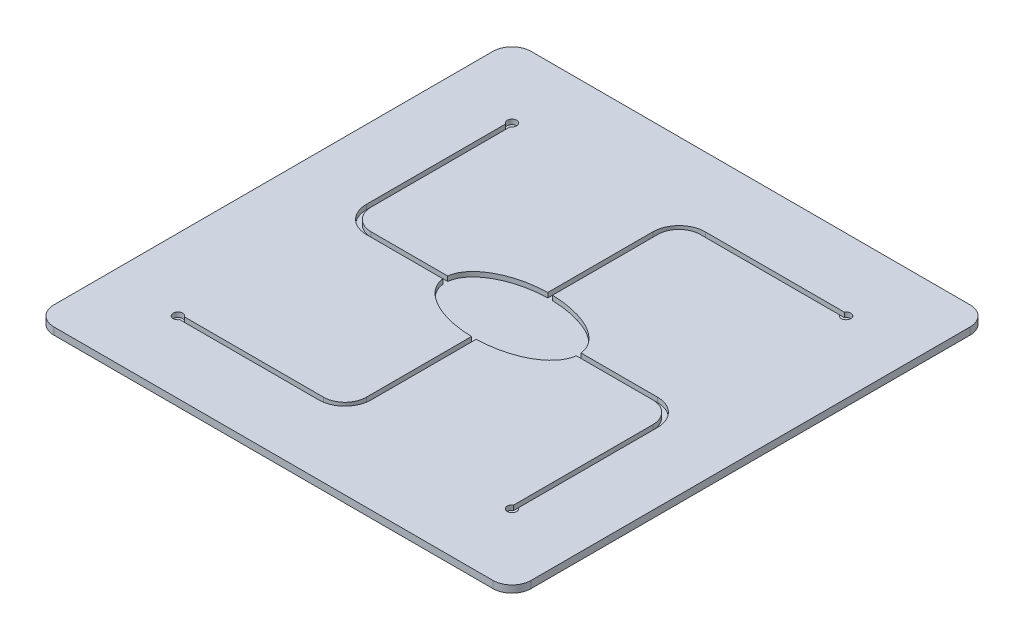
ISO-10303-21;
HEADER;
FILE_DESCRIPTION(('STEP AP214'),'2;1');
FILE_NAME('part.step','',(''),(''),'','','');
FILE_SCHEMA(('AUTOMOTIVE_DESIGN { 1 0 10303 214 1 1 1 1 }'));
ENDSEC;
DATA;
#1=APPLICATION_CONTEXT('core data for automotive mechanical design processes');
#2=APPLICATION_PROTOCOL_DEFINITION('international standard','automotive_design',2000,#1);
#3=PRODUCT_CONTEXT('',#1,'mechanical');
#4=PRODUCT('Part','Part','',(#3));
#5=PRODUCT_RELATED_PRODUCT_CATEGORY('part','',(#4));
#6=PRODUCT_DEFINITION_FORMATION('','',#4);
#7=PRODUCT_DEFINITION_CONTEXT('part definition',#1,'design');
#8=PRODUCT_DEFINITION('design','',#6,#7);
#9=PRODUCT_DEFINITION_SHAPE('','',#8);
#10=(LENGTH_UNIT() NAMED_UNIT(*) SI_UNIT(.MILLI.,.METRE.));
#11=(NAMED_UNIT(*) PLANE_ANGLE_UNIT() SI_UNIT($,.RADIAN.));
#12=(NAMED_UNIT(*) SI_UNIT($,.STERADIAN.) SOLID_ANGLE_UNIT());
#13=UNCERTAINTY_MEASURE_WITH_UNIT(LENGTH_MEASURE(1.E-05),#10,'distance_accuracy_value','');
#14=(GEOMETRIC_REPRESENTATION_CONTEXT(3) GLOBAL_UNCERTAINTY_ASSIGNED_CONTEXT((#13)) GLOBAL_UNIT_ASSIGNED_CONTEXT((#10,
#11,#12)) REPRESENTATION_CONTEXT('',''));
#15=CARTESIAN_POINT('',(0.,0.,0.));
#16=DIRECTION('',(0.,0.,1.));
#17=DIRECTION('',(1.,0.,0.));
#18=AXIS2_PLACEMENT_3D('',#15,#16,#17);
#19=CARTESIAN_POINT('',(-46.,1.5,46.));
#20=DIRECTION('',(0.,-1.,0.));
#21=DIRECTION('',(0.,0.,-1.));
#22=AXIS2_PLACEMENT_3D('',#19,#20,#21);
#23=CYLINDRICAL_SURFACE('',#22,4.);
#24=CARTESIAN_POINT('',(-46.,0.,46.));
#25=DIRECTION('',(0.,1.,0.));
#26=DIRECTION('',(0.,0.,-1.));
#27=AXIS2_PLACEMENT_3D('',#24,#25,#26);
#28=CIRCLE('',#27,4.);
#29=CARTESIAN_POINT('',(-50.,0.,46.));
#30=VERTEX_POINT('',#29);
#31=CARTESIAN_POINT('',(-45.9999999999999,0.,50.));
#32=VERTEX_POINT('',#31);
#33=EDGE_CURVE('E539',#30,#32,#28,.T.);
#34=ORIENTED_EDGE('',*,*,#33,.T.);
#35=DIRECTION('',(0.,-1.,0.));
#36=VECTOR('',#35,1.);
#37=CARTESIAN_POINT('',(-45.9999999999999,1.5,50.));
#38=LINE('',#37,#36);
#39=CARTESIAN_POINT('',(-45.9999999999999,1.5,50.));
#40=VERTEX_POINT('',#39);
#41=EDGE_CURVE('E611',#40,#32,#38,.T.);
#42=ORIENTED_EDGE('',*,*,#41,.F.);
#43=CARTESIAN_POINT('',(-46.,1.5,46.));
#44=DIRECTION('',(0.,1.,0.));
#45=DIRECTION('',(0.,0.,-1.));
#46=AXIS2_PLACEMENT_3D('',#43,#44,#45);
#47=CIRCLE('',#46,4.);
#48=CARTESIAN_POINT('',(-50.,1.5,46.));
#49=VERTEX_POINT('',#48);
#50=EDGE_CURVE('E557',#49,#40,#47,.T.);
#51=ORIENTED_EDGE('',*,*,#50,.F.);
#52=DIRECTION('',(0.,-1.,0.));
#53=VECTOR('',#52,1.);
#54=CARTESIAN_POINT('',(-50.,1.5,46.));
#55=LINE('',#54,#53);
#56=EDGE_CURVE('E575',#49,#30,#55,.T.);
#57=ORIENTED_EDGE('',*,*,#56,.T.);
#58=EDGE_LOOP('',(#34,#42,#51,#57));
#59=FACE_BOUND('',#58,.T.);
#60=ADVANCED_FACE('F148',(#59),#23,.T.);
#61=CARTESIAN_POINT('',(46.,1.5,50.));
#62=DIRECTION('',(0.,0.,-1.));
#63=DIRECTION('',(-1.,0.,0.));
#64=AXIS2_PLACEMENT_3D('',#61,#62,#63);
#65=PLANE('',#64);
#66=DIRECTION('',(1.,0.,0.));
#67=VECTOR('',#66,1.);
#68=CARTESIAN_POINT('',(46.,0.,50.));
#69=LINE('',#68,#67);
#70=CARTESIAN_POINT('',(46.,0.,50.));
#71=VERTEX_POINT('',#70);
#72=EDGE_CURVE('E578',#32,#71,#69,.T.);
#73=ORIENTED_EDGE('',*,*,#72,.T.);
#74=DIRECTION('',(0.,-1.,0.));
#75=VECTOR('',#74,1.);
#76=CARTESIAN_POINT('',(46.,1.5,50.));
#77=LINE('',#76,#75);
#78=CARTESIAN_POINT('',(46.,1.5,50.));
#79=VERTEX_POINT('',#78);
#80=EDGE_CURVE('E608',#79,#71,#77,.T.);
#81=ORIENTED_EDGE('',*,*,#80,.F.);
#82=DIRECTION('',(1.,0.,0.));
#83=VECTOR('',#82,1.);
#84=CARTESIAN_POINT('',(46.,1.5,50.));
#85=LINE('',#84,#83);
#86=EDGE_CURVE('E560',#40,#79,#85,.T.);
#87=ORIENTED_EDGE('',*,*,#86,.F.);
#88=ORIENTED_EDGE('',*,*,#41,.T.);
#89=EDGE_LOOP('',(#73,#81,#87,#88));
#90=FACE_BOUND('',#89,.T.);
#91=ADVANCED_FACE('F807',(#90),#65,.F.);
#92=CARTESIAN_POINT('',(46.,1.5,46.));
#93=DIRECTION('',(0.,-1.,0.));
#94=DIRECTION('',(0.,0.,-1.));
#95=AXIS2_PLACEMENT_3D('',#92,#93,#94);
#96=CYLINDRICAL_SURFACE('',#95,4.);
#97=CARTESIAN_POINT('',(46.,0.,46.));
#98=DIRECTION('',(0.,1.,0.));
#99=DIRECTION('',(0.,0.,1.));
#100=AXIS2_PLACEMENT_3D('',#97,#98,#99);
#101=CIRCLE('',#100,4.);
#102=CARTESIAN_POINT('',(50.,0.,46.));
#103=VERTEX_POINT('',#102);
#104=EDGE_CURVE('E580',#71,#103,#101,.T.);
#105=ORIENTED_EDGE('',*,*,#104,.T.);
#106=DIRECTION('',(0.,-1.,0.));
#107=VECTOR('',#106,1.);
#108=CARTESIAN_POINT('',(50.,1.5,46.));
#109=LINE('',#108,#107);
#110=CARTESIAN_POINT('',(50.,1.5,46.));
#111=VERTEX_POINT('',#110);
#112=EDGE_CURVE('E605',#111,#103,#109,.T.);
#113=ORIENTED_EDGE('',*,*,#112,.F.);
#114=CARTESIAN_POINT('',(46.,1.5,46.));
#115=DIRECTION('',(0.,1.,0.));
#116=DIRECTION('',(0.,0.,1.));
#117=AXIS2_PLACEMENT_3D('',#114,#115,#116);
#118=CIRCLE('',#117,4.);
#119=EDGE_CURVE('E563',#79,#111,#118,.T.);
#120=ORIENTED_EDGE('',*,*,#119,.F.);
#121=ORIENTED_EDGE('',*,*,#80,.T.);
#122=EDGE_LOOP('',(#105,#113,#120,#121));
#123=FACE_BOUND('',#122,.T.);
#124=ADVANCED_FACE('F804',(#123),#96,.T.);
#125=CARTESIAN_POINT('',(50.,1.5,46.));
#126=DIRECTION('',(-1.,0.,0.));
#127=DIRECTION('',(0.,0.,1.));
#128=AXIS2_PLACEMENT_3D('',#125,#126,#127);
#129=PLANE('',#128);
#130=DIRECTION('',(0.,0.,-1.));
#131=VECTOR('',#130,1.);
#132=CARTESIAN_POINT('',(50.,0.,46.));
#133=LINE('',#132,#131);
#134=CARTESIAN_POINT('',(50.,0.,-46.));
#135=VERTEX_POINT('',#134);
#136=EDGE_CURVE('E582',#103,#135,#133,.T.);
#137=ORIENTED_EDGE('',*,*,#136,.T.);
#138=DIRECTION('',(0.,-1.,0.));
#139=VECTOR('',#138,1.);
#140=CARTESIAN_POINT('',(50.,1.5,-46.));
#141=LINE('',#140,#139);
#142=CARTESIAN_POINT('',(50.,1.5,-46.));
#143=VERTEX_POINT('',#142);
#144=EDGE_CURVE('E602',#143,#135,#141,.T.);
#145=ORIENTED_EDGE('',*,*,#144,.F.);
#146=DIRECTION('',(0.,0.,-1.));
#147=VECTOR('',#146,1.);
#148=CARTESIAN_POINT('',(50.,1.5,46.));
#149=LINE('',#148,#147);
#150=EDGE_CURVE('E565',#111,#143,#149,.T.);
#151=ORIENTED_EDGE('',*,*,#150,.F.);
#152=ORIENTED_EDGE('',*,*,#112,.T.);
#153=EDGE_LOOP('',(#137,#145,#151,#152));
#154=FACE_BOUND('',#153,.T.);
#155=ADVANCED_FACE('F800',(#154),#129,.F.);
#156=CARTESIAN_POINT('',(46.,1.5,-46.));
#157=DIRECTION('',(0.,-1.,0.));
#158=DIRECTION('',(0.,0.,-1.));
#159=AXIS2_PLACEMENT_3D('',#156,#157,#158);
#160=CYLINDRICAL_SURFACE('',#159,4.);
#161=CARTESIAN_POINT('',(46.,0.,-46.));
#162=DIRECTION('',(0.,1.,0.));
#163=DIRECTION('',(0.,0.,-1.));
#164=AXIS2_PLACEMENT_3D('',#161,#162,#163);
#165=CIRCLE('',#164,4.);
#166=CARTESIAN_POINT('',(46.,0.,-50.));
#167=VERTEX_POINT('',#166);
#168=EDGE_CURVE('E584',#135,#167,#165,.T.);
#169=ORIENTED_EDGE('',*,*,#168,.T.);
#170=DIRECTION('',(0.,-1.,0.));
#171=VECTOR('',#170,1.);
#172=CARTESIAN_POINT('',(46.,1.5,-50.));
#173=LINE('',#172,#171);
#174=CARTESIAN_POINT('',(46.,1.5,-50.));
#175=VERTEX_POINT('',#174);
#176=EDGE_CURVE('E599',#175,#167,#173,.T.);
#177=ORIENTED_EDGE('',*,*,#176,.F.);
#178=CARTESIAN_POINT('',(46.,1.5,-46.));
#179=DIRECTION('',(0.,1.,0.));
#180=DIRECTION('',(0.,0.,-1.));
#181=AXIS2_PLACEMENT_3D('',#178,#179,#180);
#182=CIRCLE('',#181,4.);
#183=EDGE_CURVE('E567',#143,#175,#182,.T.);
#184=ORIENTED_EDGE('',*,*,#183,.F.);
#185=ORIENTED_EDGE('',*,*,#144,.T.);
#186=EDGE_LOOP('',(#169,#177,#184,#185));
#187=FACE_BOUND('',#186,.T.);
#188=ADVANCED_FACE('F796',(#187),#160,.T.);
#189=CARTESIAN_POINT('',(46.,1.5,-50.));
#190=DIRECTION('',(0.,0.,1.));
#191=DIRECTION('',(1.,0.,0.));
#192=AXIS2_PLACEMENT_3D('',#189,#190,#191);
#193=PLANE('',#192);
#194=DIRECTION('',(-1.,0.,0.));
#195=VECTOR('',#194,1.);
#196=CARTESIAN_POINT('',(46.,0.,-50.));
#197=LINE('',#196,#195);
#198=CARTESIAN_POINT('',(-45.9999999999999,0.,-50.));
#199=VERTEX_POINT('',#198);
#200=EDGE_CURVE('E586',#167,#199,#197,.T.);
#201=ORIENTED_EDGE('',*,*,#200,.T.);
#202=DIRECTION('',(0.,-1.,0.));
#203=VECTOR('',#202,1.);
#204=CARTESIAN_POINT('',(-45.9999999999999,1.5,-50.));
#205=LINE('',#204,#203);
#206=CARTESIAN_POINT('',(-45.9999999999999,1.5,-50.));
#207=VERTEX_POINT('',#206);
#208=EDGE_CURVE('E596',#207,#199,#205,.T.);
#209=ORIENTED_EDGE('',*,*,#208,.F.);
#210=DIRECTION('',(-1.,0.,0.));
#211=VECTOR('',#210,1.);
#212=CARTESIAN_POINT('',(46.,1.5,-50.));
#213=LINE('',#212,#211);
#214=EDGE_CURVE('E569',#175,#207,#213,.T.);
#215=ORIENTED_EDGE('',*,*,#214,.F.);
#216=ORIENTED_EDGE('',*,*,#176,.T.);
#217=EDGE_LOOP('',(#201,#209,#215,#216));
#218=FACE_BOUND('',#217,.T.);
#219=ADVANCED_FACE('F792',(#218),#193,.F.);
#220=CARTESIAN_POINT('',(-46.,1.5,-46.));
#221=DIRECTION('',(0.,-1.,0.));
#222=DIRECTION('',(0.,0.,-1.));
#223=AXIS2_PLACEMENT_3D('',#220,#221,#222);
#224=CYLINDRICAL_SURFACE('',#223,4.);
#225=CARTESIAN_POINT('',(-46.,0.,-46.));
#226=DIRECTION('',(0.,1.,0.));
#227=DIRECTION('',(0.,0.,-1.));
#228=AXIS2_PLACEMENT_3D('',#225,#226,#227);
#229=CIRCLE('',#228,4.);
#230=CARTESIAN_POINT('',(-50.,0.,-46.));
#231=VERTEX_POINT('',#230);
#232=EDGE_CURVE('E588',#199,#231,#229,.T.);
#233=ORIENTED_EDGE('',*,*,#232,.T.);
#234=DIRECTION('',(0.,-1.,0.));
#235=VECTOR('',#234,1.);
#236=CARTESIAN_POINT('',(-50.,1.5,-46.));
#237=LINE('',#236,#235);
#238=CARTESIAN_POINT('',(-50.,1.5,-46.));
#239=VERTEX_POINT('',#238);
#240=EDGE_CURVE('E593',#239,#231,#237,.T.);
#241=ORIENTED_EDGE('',*,*,#240,.F.);
#242=CARTESIAN_POINT('',(-46.,1.5,-46.));
#243=DIRECTION('',(0.,1.,0.));
#244=DIRECTION('',(0.,0.,-1.));
#245=AXIS2_PLACEMENT_3D('',#242,#243,#244);
#246=CIRCLE('',#245,4.);
#247=EDGE_CURVE('E571',#207,#239,#246,.T.);
#248=ORIENTED_EDGE('',*,*,#247,.F.);
#249=ORIENTED_EDGE('',*,*,#208,.T.);
#250=EDGE_LOOP('',(#233,#241,#248,#249));
#251=FACE_BOUND('',#250,.T.);
#252=ADVANCED_FACE('F788',(#251),#224,.T.);
#253=CARTESIAN_POINT('',(-50.,1.5,46.));
#254=DIRECTION('',(1.,0.,0.));
#255=DIRECTION('',(0.,0.,-1.));
#256=AXIS2_PLACEMENT_3D('',#253,#254,#255);
#257=PLANE('',#256);
#258=DIRECTION('',(0.,0.,1.));
#259=VECTOR('',#258,1.);
#260=CARTESIAN_POINT('',(-50.,0.,46.));
#261=LINE('',#260,#259);
#262=EDGE_CURVE('E561',#231,#30,#261,.T.);
#263=ORIENTED_EDGE('',*,*,#262,.T.);
#264=ORIENTED_EDGE('',*,*,#56,.F.);
#265=DIRECTION('',(0.,0.,1.));
#266=VECTOR('',#265,1.);
#267=CARTESIAN_POINT('',(-50.,1.5,46.));
#268=LINE('',#267,#266);
#269=EDGE_CURVE('E573',#239,#49,#268,.T.);
#270=ORIENTED_EDGE('',*,*,#269,.F.);
#271=ORIENTED_EDGE('',*,*,#240,.T.);
#272=EDGE_LOOP('',(#263,#264,#270,#271));
#273=FACE_BOUND('',#272,.T.);
#274=ADVANCED_FACE('F782',(#273),#257,.F.);
#275=CARTESIAN_POINT('',(-46.,1.5,46.));
#276=DIRECTION('',(0.,-1.,0.));
#277=DIRECTION('',(0.,0.,-1.));
#278=AXIS2_PLACEMENT_3D('',#275,#276,#277);
#279=PLANE('',#278);
#280=DIRECTION('',(-1.,0.,0.));
#281=VECTOR('',#280,1.);
#282=CARTESIAN_POINT('',(-5.00000000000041,1.5,35.4999999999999));
#283=LINE('',#282,#281);
#284=CARTESIAN_POINT('',(-5.00000000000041,1.5,35.4999999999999));
#285=VERTEX_POINT('',#284);
#286=CARTESIAN_POINT('',(-34.1339745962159,1.5,35.4999999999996));
#287=VERTEX_POINT('',#286);
#288=EDGE_CURVE('E419',#285,#287,#283,.T.);
#289=ORIENTED_EDGE('',*,*,#288,.T.);
#290=CARTESIAN_POINT('',(-35.0000000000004,1.5,34.9999999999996));
#291=DIRECTION('',(0.,1.,0.));
#292=DIRECTION('',(0.,0.,1.));
#293=AXIS2_PLACEMENT_3D('',#290,#291,#292);
#294=CIRCLE('',#293,0.999999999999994);
#295=CARTESIAN_POINT('',(-34.1339745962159,1.5,34.4999999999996));
#296=VERTEX_POINT('',#295);
#297=EDGE_CURVE('E401',#296,#287,#294,.T.);
#298=ORIENTED_EDGE('',*,*,#297,.F.);
#299=DIRECTION('',(-1.,0.,0.));
#300=VECTOR('',#299,1.);
#301=CARTESIAN_POINT('',(-5.0000000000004,1.5,34.4999999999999));
#302=LINE('',#301,#300);
#303=CARTESIAN_POINT('',(-5.0000000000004,1.5,34.4999999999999));
#304=VERTEX_POINT('',#303);
#305=EDGE_CURVE('E428',#304,#296,#302,.T.);
#306=ORIENTED_EDGE('',*,*,#305,.F.);
#307=CARTESIAN_POINT('',(-5.00000000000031,1.5,29.9999999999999));
#308=DIRECTION('',(0.,1.,0.));
#309=DIRECTION('',(1.,0.,0.));
#310=AXIS2_PLACEMENT_3D('',#307,#308,#309);
#311=CIRCLE('',#310,4.5);
#312=CARTESIAN_POINT('',(-0.500000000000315,1.5,29.9999999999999));
#313=VERTEX_POINT('',#312);
#314=EDGE_CURVE('E453',#313,#304,#311,.F.);
#315=ORIENTED_EDGE('',*,*,#314,.F.);
#316=DIRECTION('',(0.,0.,1.));
#317=VECTOR('',#316,1.);
#318=CARTESIAN_POINT('',(-0.500000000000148,1.5,14.));
#319=LINE('',#318,#317);
#320=CARTESIAN_POINT('',(-0.500000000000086,1.5,7.99489633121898));
#321=VERTEX_POINT('',#320);
#322=EDGE_CURVE('E449',#321,#313,#319,.T.);
#323=ORIENTED_EDGE('',*,*,#322,.F.);
#324=CARTESIAN_POINT('',(0.,1.5,0.));
#325=DIRECTION('',(0.,1.,0.));
#326=DIRECTION('',(-1.,0.,0.));
#327=AXIS2_PLACEMENT_3D('',#324,#325,#326);
#328=ELLIPSE('',#327,14.,8.);
#329=CARTESIAN_POINT('',(-13.9726294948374,1.5,0.499999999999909));
#330=VERTEX_POINT('',#329);
#331=EDGE_CURVE('E627',#330,#321,#328,.T.);
#332=ORIENTED_EDGE('',*,*,#331,.F.);
#333=DIRECTION('',(1.,0.,0.));
#334=VECTOR('',#333,1.);
#335=CARTESIAN_POINT('',(14.,1.5,0.500000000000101));
#336=LINE('',#335,#334);
#337=CARTESIAN_POINT('',(-29.9999999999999,1.5,0.499999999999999));
#338=VERTEX_POINT('',#337);
#339=EDGE_CURVE('E532',#338,#330,#336,.T.);
#340=ORIENTED_EDGE('',*,*,#339,.F.);
#341=CARTESIAN_POINT('',(-30.,1.5,-5.));
#342=DIRECTION('',(0.,1.,0.));
#343=DIRECTION('',(1.,0.,0.));
#344=AXIS2_PLACEMENT_3D('',#341,#342,#343);
#345=CIRCLE('',#344,5.5);
#346=CARTESIAN_POINT('',(-35.5,1.5,-5.00000000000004));
#347=VERTEX_POINT('',#346);
#348=EDGE_CURVE('E528',#347,#338,#345,.T.);
#349=ORIENTED_EDGE('',*,*,#348,.F.);
#350=DIRECTION('',(0.,0.,-1.));
#351=VECTOR('',#350,1.);
#352=CARTESIAN_POINT('',(-35.5,1.5,-5.00000000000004));
#353=LINE('',#352,#351);
#354=CARTESIAN_POINT('',(-35.5,1.5,-34.1339745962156));
#355=VERTEX_POINT('',#354);
#356=EDGE_CURVE('E526',#355,#347,#353,.F.);
#357=ORIENTED_EDGE('',*,*,#356,.F.);
#358=CARTESIAN_POINT('',(-35.,1.5,-35.));
#359=DIRECTION('',(0.,1.,0.));
#360=DIRECTION('',(0.,0.,1.));
#361=AXIS2_PLACEMENT_3D('',#358,#359,#360);
#362=CIRCLE('',#361,0.999999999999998);
#363=CARTESIAN_POINT('',(-34.5,1.5,-34.1339745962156));
#364=VERTEX_POINT('',#363);
#365=EDGE_CURVE('E677',#364,#355,#362,.T.);
#366=ORIENTED_EDGE('',*,*,#365,.F.);
#367=DIRECTION('',(0.,0.,-1.));
#368=VECTOR('',#367,1.);
#369=CARTESIAN_POINT('',(-34.5,1.5,-5.00000000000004));
#370=LINE('',#369,#368);
#371=CARTESIAN_POINT('',(-34.5,1.5,-5.00000000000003));
#372=VERTEX_POINT('',#371);
#373=EDGE_CURVE('E524',#364,#372,#370,.F.);
#374=ORIENTED_EDGE('',*,*,#373,.T.);
#375=CARTESIAN_POINT('',(-30.,1.5,-5.));
#376=DIRECTION('',(0.,1.,0.));
#377=DIRECTION('',(1.,0.,0.));
#378=AXIS2_PLACEMENT_3D('',#375,#376,#377);
#379=CIRCLE('',#378,4.5);
#380=CARTESIAN_POINT('',(-29.9999999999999,1.5,-0.500000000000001));
#381=VERTEX_POINT('',#380);
#382=EDGE_CURVE('E521',#372,#381,#379,.T.);
#383=ORIENTED_EDGE('',*,*,#382,.T.);
#384=DIRECTION('',(1.,0.,0.));
#385=VECTOR('',#384,1.);
#386=CARTESIAN_POINT('',(-14.,1.5,-0.500000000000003));
#387=LINE('',#386,#385);
#388=CARTESIAN_POINT('',(-13.9726294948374,1.5,-0.500000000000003));
#389=VERTEX_POINT('',#388);
#390=EDGE_CURVE('E518',#381,#389,#387,.T.);
#391=ORIENTED_EDGE('',*,*,#390,.T.);
#392=CARTESIAN_POINT('',(-0.499999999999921,1.5,-7.99489633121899));
#393=VERTEX_POINT('',#392);
#394=EDGE_CURVE('E690',#393,#389,#328,.T.);
#395=ORIENTED_EDGE('',*,*,#394,.F.);
#396=CARTESIAN_POINT('',(-0.499999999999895,1.5,-29.9999999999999));
#397=VERTEX_POINT('',#396);
#398=EDGE_CURVE('E450',#397,#393,#319,.T.);
#399=ORIENTED_EDGE('',*,*,#398,.F.);
#400=CARTESIAN_POINT('',(5.0000000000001,1.5,-30.));
#401=DIRECTION('',(0.,1.,0.));
#402=DIRECTION('',(1.,0.,0.));
#403=AXIS2_PLACEMENT_3D('',#400,#401,#402);
#404=CIRCLE('',#403,5.5);
#405=CARTESIAN_POINT('',(5.00000000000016,1.5,-35.5));
#406=VERTEX_POINT('',#405);
#407=EDGE_CURVE('E446',#406,#397,#404,.T.);
#408=ORIENTED_EDGE('',*,*,#407,.F.);
#409=DIRECTION('',(-1.,0.,0.));
#410=VECTOR('',#409,1.);
#411=CARTESIAN_POINT('',(5.00000000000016,1.5,-35.5));
#412=LINE('',#411,#410);
#413=CARTESIAN_POINT('',(34.1339745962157,1.5,-35.4999999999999));
#414=VERTEX_POINT('',#413);
#415=EDGE_CURVE('E444',#414,#406,#412,.T.);
#416=ORIENTED_EDGE('',*,*,#415,.F.);
#417=CARTESIAN_POINT('',(35.0000000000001,1.5,-34.9999999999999));
#418=DIRECTION('',(0.,1.,0.));
#419=DIRECTION('',(0.,0.,1.));
#420=AXIS2_PLACEMENT_3D('',#417,#418,#419);
#421=CIRCLE('',#420,0.999999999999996);
#422=CARTESIAN_POINT('',(34.1339745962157,1.5,-34.4999999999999));
#423=VERTEX_POINT('',#422);
#424=EDGE_CURVE('E1304',#423,#414,#421,.T.);
#425=ORIENTED_EDGE('',*,*,#424,.F.);
#426=DIRECTION('',(-1.,0.,0.));
#427=VECTOR('',#426,1.);
#428=CARTESIAN_POINT('',(5.00000000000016,1.5,-34.5));
#429=LINE('',#428,#427);
#430=CARTESIAN_POINT('',(5.00000000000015,1.5,-34.5));
#431=VERTEX_POINT('',#430);
#432=EDGE_CURVE('E442',#423,#431,#429,.T.);
#433=ORIENTED_EDGE('',*,*,#432,.T.);
#434=CARTESIAN_POINT('',(5.0000000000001,1.5,-30.));
#435=DIRECTION('',(0.,1.,0.));
#436=DIRECTION('',(1.,0.,0.));
#437=AXIS2_PLACEMENT_3D('',#434,#435,#436);
#438=CIRCLE('',#437,4.5);
#439=CARTESIAN_POINT('',(0.500000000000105,1.5,-29.9999999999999));
#440=VERTEX_POINT('',#439);
#441=EDGE_CURVE('E439',#431,#440,#438,.T.);
#442=ORIENTED_EDGE('',*,*,#441,.T.);
#443=DIRECTION('',(0.,0.,1.));
#444=VECTOR('',#443,1.);
#445=CARTESIAN_POINT('',(0.500000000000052,1.5,-14.));
#446=LINE('',#445,#444);
#447=CARTESIAN_POINT('',(0.500000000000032,1.5,-7.99489633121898));
#448=VERTEX_POINT('',#447);
#449=EDGE_CURVE('E436',#440,#448,#446,.T.);
#450=ORIENTED_EDGE('',*,*,#449,.T.);
#451=CARTESIAN_POINT('',(13.9726294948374,1.5,-0.500000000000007));
#452=VERTEX_POINT('',#451);
#453=EDGE_CURVE('E628',#452,#448,#328,.T.);
#454=ORIENTED_EDGE('',*,*,#453,.F.);
#455=CARTESIAN_POINT('',(29.9999999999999,1.5,-0.49999999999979));
#456=VERTEX_POINT('',#455);
#457=EDGE_CURVE('E517',#452,#456,#387,.T.);
#458=ORIENTED_EDGE('',*,*,#457,.T.);
#459=CARTESIAN_POINT('',(29.9999999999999,1.5,5.00000000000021));
#460=DIRECTION('',(0.,1.,0.));
#461=DIRECTION('',(1.,0.,0.));
#462=AXIS2_PLACEMENT_3D('',#459,#460,#461);
#463=CIRCLE('',#462,5.5);
#464=CARTESIAN_POINT('',(35.4999999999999,1.5,5.00000000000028));
#465=VERTEX_POINT('',#464);
#466=EDGE_CURVE('E514',#456,#465,#463,.F.);
#467=ORIENTED_EDGE('',*,*,#466,.T.);
#468=DIRECTION('',(0.,0.,1.));
#469=VECTOR('',#468,1.);
#470=CARTESIAN_POINT('',(35.4999999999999,1.5,5.00000000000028));
#471=LINE('',#470,#469);
#472=CARTESIAN_POINT('',(35.4999999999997,1.5,34.1339745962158));
#473=VERTEX_POINT('',#472);
#474=EDGE_CURVE('E511',#465,#473,#471,.T.);
#475=ORIENTED_EDGE('',*,*,#474,.T.);
#476=CARTESIAN_POINT('',(34.9999999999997,1.5,35.0000000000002));
#477=DIRECTION('',(0.,1.,0.));
#478=DIRECTION('',(0.,0.,1.));
#479=AXIS2_PLACEMENT_3D('',#476,#477,#478);
#480=CIRCLE('',#479,1.);
#481=CARTESIAN_POINT('',(34.4999999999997,1.5,34.1339745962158));
#482=VERTEX_POINT('',#481);
#483=EDGE_CURVE('E1309',#482,#473,#480,.T.);
#484=ORIENTED_EDGE('',*,*,#483,.F.);
#485=DIRECTION('',(0.,0.,1.));
#486=VECTOR('',#485,1.);
#487=CARTESIAN_POINT('',(34.4999999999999,1.5,5.00000000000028));
#488=LINE('',#487,#486);
#489=CARTESIAN_POINT('',(34.4999999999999,1.5,5.00000000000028));
#490=VERTEX_POINT('',#489);
#491=EDGE_CURVE('E459',#490,#482,#488,.T.);
#492=ORIENTED_EDGE('',*,*,#491,.F.);
#493=CARTESIAN_POINT('',(29.9999999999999,1.5,5.00000000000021));
#494=DIRECTION('',(0.,1.,0.));
#495=DIRECTION('',(1.,0.,0.));
#496=AXIS2_PLACEMENT_3D('',#493,#494,#495);
#497=CIRCLE('',#496,4.5);
#498=CARTESIAN_POINT('',(29.9999999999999,1.5,0.500000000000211));
#499=VERTEX_POINT('',#498);
#500=EDGE_CURVE('E483',#499,#490,#497,.F.);
#501=ORIENTED_EDGE('',*,*,#500,.F.);
#502=CARTESIAN_POINT('',(13.9726294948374,1.5,0.5000000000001));
#503=VERTEX_POINT('',#502);
#504=EDGE_CURVE('E531',#503,#499,#336,.T.);
#505=ORIENTED_EDGE('',*,*,#504,.F.);
#506=CARTESIAN_POINT('',(0.499999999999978,1.5,7.99489633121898));
#507=VERTEX_POINT('',#506);
#508=EDGE_CURVE('E618',#507,#503,#328,.T.);
#509=ORIENTED_EDGE('',*,*,#508,.F.);
#510=CARTESIAN_POINT('',(0.499999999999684,1.5,29.9999999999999));
#511=VERTEX_POINT('',#510);
#512=EDGE_CURVE('E430',#507,#511,#446,.T.);
#513=ORIENTED_EDGE('',*,*,#512,.T.);
#514=CARTESIAN_POINT('',(-5.00000000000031,1.5,29.9999999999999));
#515=DIRECTION('',(0.,1.,0.));
#516=DIRECTION('',(1.,0.,0.));
#517=AXIS2_PLACEMENT_3D('',#514,#515,#516);
#518=CIRCLE('',#517,5.5);
#519=EDGE_CURVE('E427',#511,#285,#518,.F.);
#520=ORIENTED_EDGE('',*,*,#519,.T.);
#521=EDGE_LOOP('',(#289,#298,#306,#315,#323,#332,#340,#349,#357,#366,#374,#383,#391,#395,#399,
#408,#416,#425,#433,#442,#450,#454,#458,#467,#475,#484,#492,#501,#505,#509,#513,#520));
#522=FACE_BOUND('',#521,.T.);
#523=ORIENTED_EDGE('',*,*,#50,.T.);
#524=ORIENTED_EDGE('',*,*,#86,.T.);
#525=ORIENTED_EDGE('',*,*,#119,.T.);
#526=ORIENTED_EDGE('',*,*,#150,.T.);
#527=ORIENTED_EDGE('',*,*,#183,.T.);
#528=ORIENTED_EDGE('',*,*,#214,.T.);
#529=ORIENTED_EDGE('',*,*,#247,.T.);
#530=ORIENTED_EDGE('',*,*,#269,.T.);
#531=EDGE_LOOP('',(#523,#524,#525,#526,#527,#528,#529,#530));
#532=FACE_BOUND('',#531,.T.);
#533=ADVANCED_FACE('F424',(#522,#532),#279,.F.);
#534=CARTESIAN_POINT('',(-46.,0.,46.));
#535=DIRECTION('',(0.,-1.,0.));
#536=DIRECTION('',(0.,0.,-1.));
#537=AXIS2_PLACEMENT_3D('',#534,#535,#536);
#538=PLANE('',#537);
#539=ORIENTED_EDGE('',*,*,#33,.F.);
#540=ORIENTED_EDGE('',*,*,#262,.F.);
#541=ORIENTED_EDGE('',*,*,#232,.F.);
#542=ORIENTED_EDGE('',*,*,#200,.F.);
#543=ORIENTED_EDGE('',*,*,#168,.F.);
#544=ORIENTED_EDGE('',*,*,#136,.F.);
#545=ORIENTED_EDGE('',*,*,#104,.F.);
#546=ORIENTED_EDGE('',*,*,#72,.F.);
#547=EDGE_LOOP('',(#539,#540,#541,#542,#543,#544,#545,#546));
#548=FACE_BOUND('',#547,.T.);
#549=ADVANCED_FACE('F781',(#548),#538,.T.);
#550=CARTESIAN_POINT('',(14.,0.5,0.500000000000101));
#551=DIRECTION('',(0.,0.,1.));
#552=DIRECTION('',(1.,0.,0.));
#553=AXIS2_PLACEMENT_3D('',#550,#551,#552);
#554=PLANE('',#553);
#555=DIRECTION('',(1.,0.,0.));
#556=VECTOR('',#555,1.);
#557=CARTESIAN_POINT('',(-14.,0.5,0.499999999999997));
#558=LINE('',#557,#556);
#559=CARTESIAN_POINT('',(13.9726294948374,0.5,0.499999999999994));
#560=VERTEX_POINT('',#559);
#561=CARTESIAN_POINT('',(29.9999999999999,0.5,0.500000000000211));
#562=VERTEX_POINT('',#561);
#563=EDGE_CURVE('E502',#560,#562,#558,.T.);
#564=ORIENTED_EDGE('',*,*,#563,.F.);
#565=DIRECTION('',(0.,1.,0.));
#566=VECTOR('',#565,1.);
#567=CARTESIAN_POINT('',(13.9726294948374,0.5,0.5000000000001));
#568=LINE('',#567,#566);
#569=EDGE_CURVE('E432',#560,#503,#568,.T.);
#570=ORIENTED_EDGE('',*,*,#569,.T.);
#571=ORIENTED_EDGE('',*,*,#504,.T.);
#572=DIRECTION('',(0.,1.,0.));
#573=VECTOR('',#572,1.);
#574=CARTESIAN_POINT('',(29.9999999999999,0.5,0.500000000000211));
#575=LINE('',#574,#573);
#576=EDGE_CURVE('E540',#562,#499,#575,.T.);
#577=ORIENTED_EDGE('',*,*,#576,.F.);
#578=EDGE_LOOP('',(#564,#570,#571,#577));
#579=FACE_BOUND('',#578,.T.);
#580=ADVANCED_FACE('F748',(#579),#554,.F.);
#581=CARTESIAN_POINT('',(-14.,0.5,-0.500000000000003));
#582=DIRECTION('',(0.,0.,1.));
#583=DIRECTION('',(1.,0.,0.));
#584=AXIS2_PLACEMENT_3D('',#581,#582,#583);
#585=PLANE('',#584);
#586=DIRECTION('',(0.,1.,0.));
#587=VECTOR('',#586,1.);
#588=CARTESIAN_POINT('',(13.9726294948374,0.5,-0.500000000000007));
#589=LINE('',#588,#587);
#590=CARTESIAN_POINT('',(13.9726294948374,0.5,-0.499999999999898));
#591=VERTEX_POINT('',#590);
#592=EDGE_CURVE('E1325',#591,#452,#589,.T.);
#593=ORIENTED_EDGE('',*,*,#592,.F.);
#594=DIRECTION('',(1.,0.,0.));
#595=VECTOR('',#594,1.);
#596=CARTESIAN_POINT('',(14.,0.5,-0.499999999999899));
#597=LINE('',#596,#595);
#598=CARTESIAN_POINT('',(29.9999999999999,0.5,-0.49999999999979));
#599=VERTEX_POINT('',#598);
#600=EDGE_CURVE('E488',#591,#599,#597,.T.);
#601=ORIENTED_EDGE('',*,*,#600,.T.);
#602=DIRECTION('',(0.,1.,0.));
#603=VECTOR('',#602,1.);
#604=CARTESIAN_POINT('',(29.9999999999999,0.5,-0.49999999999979));
#605=LINE('',#604,#603);
#606=EDGE_CURVE('E553',#599,#456,#605,.T.);
#607=ORIENTED_EDGE('',*,*,#606,.T.);
#608=ORIENTED_EDGE('',*,*,#457,.F.);
#609=EDGE_LOOP('',(#593,#601,#607,#608));
#610=FACE_BOUND('',#609,.T.);
#611=ADVANCED_FACE('F769',(#610),#585,.T.);
#612=CARTESIAN_POINT('',(34.4999999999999,0.5,5.00000000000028));
#613=DIRECTION('',(-1.,0.,0.));
#614=DIRECTION('',(0.,0.,1.));
#615=AXIS2_PLACEMENT_3D('',#612,#613,#614);
#616=PLANE('',#615);
#617=ORIENTED_EDGE('',*,*,#491,.T.);
#618=DIRECTION('',(0.,1.,0.));
#619=VECTOR('',#618,1.);
#620=CARTESIAN_POINT('',(34.4999999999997,0.5,34.1339745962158));
#621=LINE('',#620,#619);
#622=CARTESIAN_POINT('',(34.4999999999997,0.5,34.1339745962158));
#623=VERTEX_POINT('',#622);
#624=EDGE_CURVE('E687',#482,#623,#621,.F.);
#625=ORIENTED_EDGE('',*,*,#624,.T.);
#626=DIRECTION('',(0.,0.,1.));
#627=VECTOR('',#626,1.);
#628=CARTESIAN_POINT('',(34.4999999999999,0.5,5.00000000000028));
#629=LINE('',#628,#627);
#630=CARTESIAN_POINT('',(34.4999999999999,0.5,5.00000000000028));
#631=VERTEX_POINT('',#630);
#632=EDGE_CURVE('E479',#631,#623,#629,.T.);
#633=ORIENTED_EDGE('',*,*,#632,.F.);
#634=DIRECTION('',(0.,1.,0.));
#635=VECTOR('',#634,1.);
#636=CARTESIAN_POINT('',(34.4999999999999,0.5,5.00000000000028));
#637=LINE('',#636,#635);
#638=EDGE_CURVE('E537',#631,#490,#637,.T.);
#639=ORIENTED_EDGE('',*,*,#638,.T.);
#640=EDGE_LOOP('',(#617,#625,#633,#639));
#641=FACE_BOUND('',#640,.T.);
#642=ADVANCED_FACE('F742',(#641),#616,.F.);
#643=CARTESIAN_POINT('',(29.9999999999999,0.5,5.00000000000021));
#644=DIRECTION('',(0.,1.,0.));
#645=DIRECTION('',(0.,0.,1.));
#646=AXIS2_PLACEMENT_3D('',#643,#644,#645);
#647=CYLINDRICAL_SURFACE('',#646,4.5);
#648=ORIENTED_EDGE('',*,*,#500,.T.);
#649=ORIENTED_EDGE('',*,*,#638,.F.);
#650=CARTESIAN_POINT('',(29.9999999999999,0.5,5.00000000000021));
#651=DIRECTION('',(0.,1.,0.));
#652=DIRECTION('',(1.,0.,0.));
#653=AXIS2_PLACEMENT_3D('',#650,#651,#652);
#654=CIRCLE('',#653,4.5);
#655=EDGE_CURVE('E505',#562,#631,#654,.F.);
#656=ORIENTED_EDGE('',*,*,#655,.F.);
#657=ORIENTED_EDGE('',*,*,#576,.T.);
#658=EDGE_LOOP('',(#648,#649,#656,#657));
#659=FACE_BOUND('',#658,.T.);
#660=ADVANCED_FACE('F738',(#659),#647,.T.);
#661=ORIENTED_EDGE('',*,*,#339,.T.);
#662=DIRECTION('',(0.,1.,0.));
#663=VECTOR('',#662,1.);
#664=CARTESIAN_POINT('',(-13.9726294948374,0.5,0.499999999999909));
#665=LINE('',#664,#663);
#666=CARTESIAN_POINT('',(-13.9726294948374,0.5,0.499999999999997));
#667=VERTEX_POINT('',#666);
#668=EDGE_CURVE('E1327',#330,#667,#665,.F.);
#669=ORIENTED_EDGE('',*,*,#668,.T.);
#670=CARTESIAN_POINT('',(-29.9999999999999,0.5,0.499999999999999));
#671=VERTEX_POINT('',#670);
#672=EDGE_CURVE('E503',#671,#667,#558,.T.);
#673=ORIENTED_EDGE('',*,*,#672,.F.);
#674=DIRECTION('',(0.,1.,0.));
#675=VECTOR('',#674,1.);
#676=CARTESIAN_POINT('',(-29.9999999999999,0.5,0.499999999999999));
#677=LINE('',#676,#675);
#678=EDGE_CURVE('E543',#671,#338,#677,.T.);
#679=ORIENTED_EDGE('',*,*,#678,.T.);
#680=EDGE_LOOP('',(#661,#669,#673,#679));
#681=FACE_BOUND('',#680,.T.);
#682=ADVANCED_FACE('F741',(#681),#554,.F.);
#683=CARTESIAN_POINT('',(-30.,0.5,-5.));
#684=DIRECTION('',(0.,1.,0.));
#685=DIRECTION('',(0.,0.,1.));
#686=AXIS2_PLACEMENT_3D('',#683,#684,#685);
#687=CYLINDRICAL_SURFACE('',#686,5.5);
#688=ORIENTED_EDGE('',*,*,#348,.T.);
#689=ORIENTED_EDGE('',*,*,#678,.F.);
#690=CARTESIAN_POINT('',(-30.,0.5,-5.));
#691=DIRECTION('',(0.,1.,0.));
#692=DIRECTION('',(1.,0.,0.));
#693=AXIS2_PLACEMENT_3D('',#690,#691,#692);
#694=CIRCLE('',#693,5.5);
#695=CARTESIAN_POINT('',(-35.5,0.5,-5.00000000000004));
#696=VERTEX_POINT('',#695);
#697=EDGE_CURVE('E499',#696,#671,#694,.T.);
#698=ORIENTED_EDGE('',*,*,#697,.F.);
#699=DIRECTION('',(0.,1.,0.));
#700=VECTOR('',#699,1.);
#701=CARTESIAN_POINT('',(-35.5,0.5,-5.00000000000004));
#702=LINE('',#701,#700);
#703=EDGE_CURVE('E545',#696,#347,#702,.T.);
#704=ORIENTED_EDGE('',*,*,#703,.T.);
#705=EDGE_LOOP('',(#688,#689,#698,#704));
#706=FACE_BOUND('',#705,.T.);
#707=ADVANCED_FACE('F746',(#706),#687,.F.);
#708=CARTESIAN_POINT('',(-35.5,0.5,-5.00000000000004));
#709=DIRECTION('',(-1.,0.,0.));
#710=DIRECTION('',(0.,0.,1.));
#711=AXIS2_PLACEMENT_3D('',#708,#709,#710);
#712=PLANE('',#711);
#713=DIRECTION('',(0.,0.,-1.));
#714=VECTOR('',#713,1.);
#715=CARTESIAN_POINT('',(-35.5,0.5,-5.00000000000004));
#716=LINE('',#715,#714);
#717=CARTESIAN_POINT('',(-35.5,0.5,-34.1339745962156));
#718=VERTEX_POINT('',#717);
#719=EDGE_CURVE('E497',#718,#696,#716,.F.);
#720=ORIENTED_EDGE('',*,*,#719,.F.);
#721=DIRECTION('',(0.,1.,0.));
#722=VECTOR('',#721,1.);
#723=CARTESIAN_POINT('',(-35.5,0.5,-34.1339745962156));
#724=LINE('',#723,#722);
#725=EDGE_CURVE('E682',#718,#355,#724,.T.);
#726=ORIENTED_EDGE('',*,*,#725,.T.);
#727=ORIENTED_EDGE('',*,*,#356,.T.);
#728=ORIENTED_EDGE('',*,*,#703,.F.);
#729=EDGE_LOOP('',(#720,#726,#727,#728));
#730=FACE_BOUND('',#729,.T.);
#731=ADVANCED_FACE('F751',(#730),#712,.F.);
#732=CARTESIAN_POINT('',(-34.5,0.5,-5.00000000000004));
#733=DIRECTION('',(-1.,0.,0.));
#734=DIRECTION('',(0.,0.,1.));
#735=AXIS2_PLACEMENT_3D('',#732,#733,#734);
#736=PLANE('',#735);
#737=DIRECTION('',(0.,1.,0.));
#738=VECTOR('',#737,1.);
#739=CARTESIAN_POINT('',(-34.5,0.5,-34.1339745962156));
#740=LINE('',#739,#738);
#741=CARTESIAN_POINT('',(-34.5,0.5,-34.1339745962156));
#742=VERTEX_POINT('',#741);
#743=EDGE_CURVE('E675',#742,#364,#740,.T.);
#744=ORIENTED_EDGE('',*,*,#743,.F.);
#745=DIRECTION('',(0.,0.,-1.));
#746=VECTOR('',#745,1.);
#747=CARTESIAN_POINT('',(-34.5,0.5,-5.00000000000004));
#748=LINE('',#747,#746);
#749=CARTESIAN_POINT('',(-34.5,0.5,-5.00000000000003));
#750=VERTEX_POINT('',#749);
#751=EDGE_CURVE('E495',#742,#750,#748,.F.);
#752=ORIENTED_EDGE('',*,*,#751,.T.);
#753=DIRECTION('',(0.,1.,0.));
#754=VECTOR('',#753,1.);
#755=CARTESIAN_POINT('',(-34.5,0.5,-5.00000000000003));
#756=LINE('',#755,#754);
#757=EDGE_CURVE('E548',#750,#372,#756,.T.);
#758=ORIENTED_EDGE('',*,*,#757,.T.);
#759=ORIENTED_EDGE('',*,*,#373,.F.);
#760=EDGE_LOOP('',(#744,#752,#758,#759));
#761=FACE_BOUND('',#760,.T.);
#762=ADVANCED_FACE('F755',(#761),#736,.T.);
#763=CARTESIAN_POINT('',(-30.,0.5,-5.));
#764=DIRECTION('',(0.,1.,0.));
#765=DIRECTION('',(0.,0.,1.));
#766=AXIS2_PLACEMENT_3D('',#763,#764,#765);
#767=CYLINDRICAL_SURFACE('',#766,4.5);
#768=ORIENTED_EDGE('',*,*,#382,.F.);
#769=ORIENTED_EDGE('',*,*,#757,.F.);
#770=CARTESIAN_POINT('',(-30.,0.5,-5.));
#771=DIRECTION('',(0.,1.,0.));
#772=DIRECTION('',(1.,0.,0.));
#773=AXIS2_PLACEMENT_3D('',#770,#771,#772);
#774=CIRCLE('',#773,4.5);
#775=CARTESIAN_POINT('',(-29.9999999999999,0.5,-0.500000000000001));
#776=VERTEX_POINT('',#775);
#777=EDGE_CURVE('E492',#750,#776,#774,.T.);
#778=ORIENTED_EDGE('',*,*,#777,.T.);
#779=DIRECTION('',(0.,1.,0.));
#780=VECTOR('',#779,1.);
#781=CARTESIAN_POINT('',(-29.9999999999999,0.5,-0.500000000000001));
#782=LINE('',#781,#780);
#783=EDGE_CURVE('E551',#776,#381,#782,.T.);
#784=ORIENTED_EDGE('',*,*,#783,.T.);
#785=EDGE_LOOP('',(#768,#769,#778,#784));
#786=FACE_BOUND('',#785,.T.);
#787=ADVANCED_FACE('F759',(#786),#767,.T.);
#788=DIRECTION('',(0.,1.,0.));
#789=VECTOR('',#788,1.);
#790=CARTESIAN_POINT('',(-13.9726294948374,0.5,-0.500000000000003));
#791=LINE('',#790,#789);
#792=CARTESIAN_POINT('',(-13.9726294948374,0.5,-0.500000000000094));
#793=VERTEX_POINT('',#792);
#794=EDGE_CURVE('E1300',#389,#793,#791,.F.);
#795=ORIENTED_EDGE('',*,*,#794,.F.);
#796=ORIENTED_EDGE('',*,*,#390,.F.);
#797=ORIENTED_EDGE('',*,*,#783,.F.);
#798=EDGE_CURVE('E489',#776,#793,#597,.T.);
#799=ORIENTED_EDGE('',*,*,#798,.T.);
#800=EDGE_LOOP('',(#795,#796,#797,#799));
#801=FACE_BOUND('',#800,.T.);
#802=ADVANCED_FACE('F763',(#801),#585,.T.);
#803=CARTESIAN_POINT('',(29.9999999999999,0.5,5.00000000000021));
#804=DIRECTION('',(0.,1.,0.));
#805=DIRECTION('',(0.,0.,1.));
#806=AXIS2_PLACEMENT_3D('',#803,#804,#805);
#807=CYLINDRICAL_SURFACE('',#806,5.5);
#808=ORIENTED_EDGE('',*,*,#466,.F.);
#809=ORIENTED_EDGE('',*,*,#606,.F.);
#810=CARTESIAN_POINT('',(29.9999999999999,0.5,5.00000000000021));
#811=DIRECTION('',(0.,1.,0.));
#812=DIRECTION('',(1.,0.,0.));
#813=AXIS2_PLACEMENT_3D('',#810,#811,#812);
#814=CIRCLE('',#813,5.5);
#815=CARTESIAN_POINT('',(35.4999999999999,0.5,5.00000000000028));
#816=VERTEX_POINT('',#815);
#817=EDGE_CURVE('E486',#599,#816,#814,.F.);
#818=ORIENTED_EDGE('',*,*,#817,.T.);
#819=DIRECTION('',(0.,1.,0.));
#820=VECTOR('',#819,1.);
#821=CARTESIAN_POINT('',(35.4999999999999,0.5,5.00000000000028));
#822=LINE('',#821,#820);
#823=EDGE_CURVE('E508',#816,#465,#822,.T.);
#824=ORIENTED_EDGE('',*,*,#823,.T.);
#825=EDGE_LOOP('',(#808,#809,#818,#824));
#826=FACE_BOUND('',#825,.T.);
#827=ADVANCED_FACE('F767',(#826),#807,.F.);
#828=CARTESIAN_POINT('',(35.4999999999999,0.5,5.00000000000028));
#829=DIRECTION('',(-1.,0.,0.));
#830=DIRECTION('',(0.,0.,1.));
#831=AXIS2_PLACEMENT_3D('',#828,#829,#830);
#832=PLANE('',#831);
#833=DIRECTION('',(0.,1.,0.));
#834=VECTOR('',#833,1.);
#835=CARTESIAN_POINT('',(35.4999999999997,0.5,34.1339745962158));
#836=LINE('',#835,#834);
#837=CARTESIAN_POINT('',(35.4999999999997,0.5,34.1339745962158));
#838=VERTEX_POINT('',#837);
#839=EDGE_CURVE('E685',#473,#838,#836,.F.);
#840=ORIENTED_EDGE('',*,*,#839,.F.);
#841=ORIENTED_EDGE('',*,*,#474,.F.);
#842=ORIENTED_EDGE('',*,*,#823,.F.);
#843=DIRECTION('',(0.,0.,1.));
#844=VECTOR('',#843,1.);
#845=CARTESIAN_POINT('',(35.4999999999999,0.5,5.00000000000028));
#846=LINE('',#845,#844);
#847=EDGE_CURVE('E482',#816,#838,#846,.T.);
#848=ORIENTED_EDGE('',*,*,#847,.T.);
#849=EDGE_LOOP('',(#840,#841,#842,#848));
#850=FACE_BOUND('',#849,.T.);
#851=ADVANCED_FACE('F737',(#850),#832,.T.);
#852=CARTESIAN_POINT('',(29.9999999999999,0.5,5.00000000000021));
#853=DIRECTION('',(0.,1.,0.));
#854=DIRECTION('',(1.,0.,0.));
#855=AXIS2_PLACEMENT_3D('',#852,#853,#854);
#856=PLANE('',#855);
#857=CARTESIAN_POINT('',(-35.,0.5,-35.));
#858=DIRECTION('',(0.,1.,0.));
#859=DIRECTION('',(0.,0.,1.));
#860=AXIS2_PLACEMENT_3D('',#857,#858,#859);
#861=CIRCLE('',#860,0.999999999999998);
#862=EDGE_CURVE('E672',#742,#718,#861,.T.);
#863=ORIENTED_EDGE('',*,*,#862,.T.);
#864=ORIENTED_EDGE('',*,*,#719,.T.);
#865=ORIENTED_EDGE('',*,*,#697,.T.);
#866=ORIENTED_EDGE('',*,*,#672,.T.);
#867=CARTESIAN_POINT('',(0.,0.5,0.));
#868=DIRECTION('',(0.,1.,0.));
#869=DIRECTION('',(-1.,0.,0.));
#870=AXIS2_PLACEMENT_3D('',#867,#868,#869);
#871=ELLIPSE('',#870,14.,8.);
#872=CARTESIAN_POINT('',(-0.500000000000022,0.5,7.99489633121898));
#873=VERTEX_POINT('',#872);
#874=EDGE_CURVE('E169',#667,#873,#871,.T.);
#875=ORIENTED_EDGE('',*,*,#874,.T.);
#876=DIRECTION('',(0.,0.,1.));
#877=VECTOR('',#876,1.);
#878=CARTESIAN_POINT('',(-0.499999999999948,0.5,-14.));
#879=LINE('',#878,#877);
#880=CARTESIAN_POINT('',(-0.500000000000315,0.5,29.9999999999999));
#881=VERTEX_POINT('',#880);
#882=EDGE_CURVE('E658',#873,#881,#879,.T.);
#883=ORIENTED_EDGE('',*,*,#882,.T.);
#884=CARTESIAN_POINT('',(-5.00000000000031,0.5,29.9999999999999));
#885=DIRECTION('',(0.,1.,0.));
#886=DIRECTION('',(1.,0.,0.));
#887=AXIS2_PLACEMENT_3D('',#884,#885,#886);
#888=CIRCLE('',#887,4.5);
#889=CARTESIAN_POINT('',(-5.0000000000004,0.5,34.4999999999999));
#890=VERTEX_POINT('',#889);
#891=EDGE_CURVE('E478',#881,#890,#888,.F.);
#892=ORIENTED_EDGE('',*,*,#891,.T.);
#893=DIRECTION('',(-1.,0.,0.));
#894=VECTOR('',#893,1.);
#895=CARTESIAN_POINT('',(-5.0000000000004,0.5,34.4999999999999));
#896=LINE('',#895,#894);
#897=CARTESIAN_POINT('',(-34.1339745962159,0.5,34.4999999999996));
#898=VERTEX_POINT('',#897);
#899=EDGE_CURVE('E456',#890,#898,#896,.T.);
#900=ORIENTED_EDGE('',*,*,#899,.T.);
#901=CARTESIAN_POINT('',(-35.0000000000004,0.5,34.9999999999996));
#902=DIRECTION('',(0.,1.,0.));
#903=DIRECTION('',(0.,0.,1.));
#904=AXIS2_PLACEMENT_3D('',#901,#902,#903);
#905=CIRCLE('',#904,0.999999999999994);
#906=CARTESIAN_POINT('',(-34.1339745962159,0.5,35.4999999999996));
#907=VERTEX_POINT('',#906);
#908=EDGE_CURVE('E412',#898,#907,#905,.T.);
#909=ORIENTED_EDGE('',*,*,#908,.T.);
#910=DIRECTION('',(-1.,0.,0.));
#911=VECTOR('',#910,1.);
#912=CARTESIAN_POINT('',(-5.00000000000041,0.5,35.4999999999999));
#913=LINE('',#912,#911);
#914=CARTESIAN_POINT('',(-5.00000000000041,0.5,35.4999999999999));
#915=VERTEX_POINT('',#914);
#916=EDGE_CURVE('E422',#915,#907,#913,.T.);
#917=ORIENTED_EDGE('',*,*,#916,.F.);
#918=CARTESIAN_POINT('',(-5.00000000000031,0.5,29.9999999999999));
#919=DIRECTION('',(0.,1.,0.));
#920=DIRECTION('',(1.,0.,0.));
#921=AXIS2_PLACEMENT_3D('',#918,#919,#920);
#922=CIRCLE('',#921,5.5);
#923=CARTESIAN_POINT('',(0.499999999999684,0.5,29.9999999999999));
#924=VERTEX_POINT('',#923);
#925=EDGE_CURVE('E636',#924,#915,#922,.F.);
#926=ORIENTED_EDGE('',*,*,#925,.F.);
#927=DIRECTION('',(0.,0.,1.));
#928=VECTOR('',#927,1.);
#929=CARTESIAN_POINT('',(0.499999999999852,0.5,14.));
#930=LINE('',#929,#928);
#931=CARTESIAN_POINT('',(0.499999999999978,0.5,7.99489633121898));
#932=VERTEX_POINT('',#931);
#933=EDGE_CURVE('E632',#932,#924,#930,.T.);
#934=ORIENTED_EDGE('',*,*,#933,.F.);
#935=EDGE_CURVE('E621',#932,#560,#871,.T.);
#936=ORIENTED_EDGE('',*,*,#935,.T.);
#937=ORIENTED_EDGE('',*,*,#563,.T.);
#938=ORIENTED_EDGE('',*,*,#655,.T.);
#939=ORIENTED_EDGE('',*,*,#632,.T.);
#940=CARTESIAN_POINT('',(34.9999999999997,0.5,35.0000000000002));
#941=DIRECTION('',(0.,1.,0.));
#942=DIRECTION('',(0.,0.,1.));
#943=AXIS2_PLACEMENT_3D('',#940,#941,#942);
#944=CIRCLE('',#943,1.);
#945=EDGE_CURVE('E411',#623,#838,#944,.T.);
#946=ORIENTED_EDGE('',*,*,#945,.T.);
#947=ORIENTED_EDGE('',*,*,#847,.F.);
#948=ORIENTED_EDGE('',*,*,#817,.F.);
#949=ORIENTED_EDGE('',*,*,#600,.F.);
#950=CARTESIAN_POINT('',(0.500000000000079,0.5,-7.99489633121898));
#951=VERTEX_POINT('',#950);
#952=EDGE_CURVE('E162',#591,#951,#871,.T.);
#953=ORIENTED_EDGE('',*,*,#952,.T.);
#954=CARTESIAN_POINT('',(0.500000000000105,0.5,-29.9999999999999));
#955=VERTEX_POINT('',#954);
#956=EDGE_CURVE('E645',#955,#951,#930,.T.);
#957=ORIENTED_EDGE('',*,*,#956,.F.);
#958=CARTESIAN_POINT('',(5.0000000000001,0.5,-30.));
#959=DIRECTION('',(0.,1.,0.));
#960=DIRECTION('',(1.,0.,0.));
#961=AXIS2_PLACEMENT_3D('',#958,#959,#960);
#962=CIRCLE('',#961,4.5);
#963=CARTESIAN_POINT('',(5.00000000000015,0.5,-34.5));
#964=VERTEX_POINT('',#963);
#965=EDGE_CURVE('E648',#964,#955,#962,.T.);
#966=ORIENTED_EDGE('',*,*,#965,.F.);
#967=DIRECTION('',(-1.,0.,0.));
#968=VECTOR('',#967,1.);
#969=CARTESIAN_POINT('',(5.00000000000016,0.5,-34.5));
#970=LINE('',#969,#968);
#971=CARTESIAN_POINT('',(34.1339745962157,0.5,-34.4999999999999));
#972=VERTEX_POINT('',#971);
#973=EDGE_CURVE('E651',#972,#964,#970,.T.);
#974=ORIENTED_EDGE('',*,*,#973,.F.);
#975=CARTESIAN_POINT('',(35.0000000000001,0.5,-34.9999999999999));
#976=DIRECTION('',(0.,1.,0.));
#977=DIRECTION('',(0.,0.,1.));
#978=AXIS2_PLACEMENT_3D('',#975,#976,#977);
#979=CIRCLE('',#978,0.999999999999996);
#980=CARTESIAN_POINT('',(34.1339745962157,0.5,-35.4999999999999));
#981=VERTEX_POINT('',#980);
#982=EDGE_CURVE('E1305',#972,#981,#979,.T.);
#983=ORIENTED_EDGE('',*,*,#982,.T.);
#984=DIRECTION('',(-1.,0.,0.));
#985=VECTOR('',#984,1.);
#986=CARTESIAN_POINT('',(5.00000000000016,0.5,-35.5));
#987=LINE('',#986,#985);
#988=CARTESIAN_POINT('',(5.00000000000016,0.5,-35.5));
#989=VERTEX_POINT('',#988);
#990=EDGE_CURVE('E653',#981,#989,#987,.T.);
#991=ORIENTED_EDGE('',*,*,#990,.T.);
#992=CARTESIAN_POINT('',(5.0000000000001,0.5,-30.));
#993=DIRECTION('',(0.,1.,0.));
#994=DIRECTION('',(1.,0.,0.));
#995=AXIS2_PLACEMENT_3D('',#992,#993,#994);
#996=CIRCLE('',#995,5.5);
#997=CARTESIAN_POINT('',(-0.499999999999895,0.5,-29.9999999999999));
#998=VERTEX_POINT('',#997);
#999=EDGE_CURVE('E655',#989,#998,#996,.T.);
#1000=ORIENTED_EDGE('',*,*,#999,.T.);
#1001=CARTESIAN_POINT('',(-0.499999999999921,0.5,-7.99489633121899));
#1002=VERTEX_POINT('',#1001);
#1003=EDGE_CURVE('E659',#998,#1002,#879,.T.);
#1004=ORIENTED_EDGE('',*,*,#1003,.T.);
#1005=EDGE_CURVE('E693',#1002,#793,#871,.T.);
#1006=ORIENTED_EDGE('',*,*,#1005,.T.);
#1007=ORIENTED_EDGE('',*,*,#798,.F.);
#1008=ORIENTED_EDGE('',*,*,#777,.F.);
#1009=ORIENTED_EDGE('',*,*,#751,.F.);
#1010=EDGE_LOOP('',(#863,#864,#865,#866,#875,#883,#892,#900,#909,#917,#926,#934,#936,#937,#938,
#939,#946,#947,#948,#949,#953,#957,#966,#974,#983,#991,#1000,#1004,#1006,#1007,#1008,#1009));
#1011=FACE_BOUND('',#1010,.T.);
#1012=ADVANCED_FACE('F638',(#1011),#856,.T.);
#1013=CARTESIAN_POINT('',(5.0000000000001,0.5,-30.));
#1014=DIRECTION('',(0.,1.,0.));
#1015=DIRECTION('',(0.,0.,1.));
#1016=AXIS2_PLACEMENT_3D('',#1013,#1014,#1015);
#1017=CYLINDRICAL_SURFACE('',#1016,5.5);
#1018=ORIENTED_EDGE('',*,*,#407,.T.);
#1019=DIRECTION('',(0.,1.,0.));
#1020=VECTOR('',#1019,1.);
#1021=CARTESIAN_POINT('',(-0.499999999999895,0.5,-29.9999999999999));
#1022=LINE('',#1021,#1020);
#1023=EDGE_CURVE('E463',#998,#397,#1022,.T.);
#1024=ORIENTED_EDGE('',*,*,#1023,.F.);
#1025=ORIENTED_EDGE('',*,*,#999,.F.);
#1026=DIRECTION('',(0.,1.,0.));
#1027=VECTOR('',#1026,1.);
#1028=CARTESIAN_POINT('',(5.00000000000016,0.5,-35.5));
#1029=LINE('',#1028,#1027);
#1030=EDGE_CURVE('E465',#989,#406,#1029,.T.);
#1031=ORIENTED_EDGE('',*,*,#1030,.T.);
#1032=EDGE_LOOP('',(#1018,#1024,#1025,#1031));
#1033=FACE_BOUND('',#1032,.T.);
#1034=ADVANCED_FACE('F710',(#1033),#1017,.F.);
#1035=CARTESIAN_POINT('',(5.00000000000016,0.5,-35.5));
#1036=DIRECTION('',(0.,0.,-1.));
#1037=DIRECTION('',(-1.,0.,0.));
#1038=AXIS2_PLACEMENT_3D('',#1035,#1036,#1037);
#1039=PLANE('',#1038);
#1040=ORIENTED_EDGE('',*,*,#990,.F.);
#1041=DIRECTION('',(0.,1.,0.));
#1042=VECTOR('',#1041,1.);
#1043=CARTESIAN_POINT('',(34.1339745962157,0.5,-35.4999999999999));
#1044=LINE('',#1043,#1042);
#1045=EDGE_CURVE('E671',#981,#414,#1044,.T.);
#1046=ORIENTED_EDGE('',*,*,#1045,.T.);
#1047=ORIENTED_EDGE('',*,*,#415,.T.);
#1048=ORIENTED_EDGE('',*,*,#1030,.F.);
#1049=EDGE_LOOP('',(#1040,#1046,#1047,#1048));
#1050=FACE_BOUND('',#1049,.T.);
#1051=ADVANCED_FACE('F713',(#1050),#1039,.F.);
#1052=CARTESIAN_POINT('',(5.00000000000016,0.5,-34.5));
#1053=DIRECTION('',(0.,0.,-1.));
#1054=DIRECTION('',(-1.,0.,0.));
#1055=AXIS2_PLACEMENT_3D('',#1052,#1053,#1054);
#1056=PLANE('',#1055);
#1057=DIRECTION('',(0.,1.,0.));
#1058=VECTOR('',#1057,1.);
#1059=CARTESIAN_POINT('',(34.1339745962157,0.5,-34.4999999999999));
#1060=LINE('',#1059,#1058);
#1061=EDGE_CURVE('E12',#972,#423,#1060,.T.);
#1062=ORIENTED_EDGE('',*,*,#1061,.F.);
#1063=ORIENTED_EDGE('',*,*,#973,.T.);
#1064=DIRECTION('',(0.,1.,0.));
#1065=VECTOR('',#1064,1.);
#1066=CARTESIAN_POINT('',(5.00000000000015,0.5,-34.5));
#1067=LINE('',#1066,#1065);
#1068=EDGE_CURVE('E468',#964,#431,#1067,.T.);
#1069=ORIENTED_EDGE('',*,*,#1068,.T.);
#1070=ORIENTED_EDGE('',*,*,#432,.F.);
#1071=EDGE_LOOP('',(#1062,#1063,#1069,#1070));
#1072=FACE_BOUND('',#1071,.T.);
#1073=ADVANCED_FACE('F717',(#1072),#1056,.T.);
#1074=CARTESIAN_POINT('',(5.0000000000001,0.5,-30.));
#1075=DIRECTION('',(0.,1.,0.));
#1076=DIRECTION('',(0.,0.,1.));
#1077=AXIS2_PLACEMENT_3D('',#1074,#1075,#1076);
#1078=CYLINDRICAL_SURFACE('',#1077,4.5);
#1079=ORIENTED_EDGE('',*,*,#441,.F.);
#1080=ORIENTED_EDGE('',*,*,#1068,.F.);
#1081=ORIENTED_EDGE('',*,*,#965,.T.);
#1082=DIRECTION('',(0.,1.,0.));
#1083=VECTOR('',#1082,1.);
#1084=CARTESIAN_POINT('',(0.500000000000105,0.5,-29.9999999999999));
#1085=LINE('',#1084,#1083);
#1086=EDGE_CURVE('E471',#955,#440,#1085,.T.);
#1087=ORIENTED_EDGE('',*,*,#1086,.T.);
#1088=EDGE_LOOP('',(#1079,#1080,#1081,#1087));
#1089=FACE_BOUND('',#1088,.T.);
#1090=ADVANCED_FACE('F721',(#1089),#1078,.T.);
#1091=CARTESIAN_POINT('',(0.500000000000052,0.5,-14.));
#1092=DIRECTION('',(-1.,0.,0.));
#1093=DIRECTION('',(0.,0.,1.));
#1094=AXIS2_PLACEMENT_3D('',#1091,#1092,#1093);
#1095=PLANE('',#1094);
#1096=DIRECTION('',(0.,1.,0.));
#1097=VECTOR('',#1096,1.);
#1098=CARTESIAN_POINT('',(0.500000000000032,0.5,-7.99489633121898));
#1099=LINE('',#1098,#1097);
#1100=EDGE_CURVE('E1333',#448,#951,#1099,.F.);
#1101=ORIENTED_EDGE('',*,*,#1100,.F.);
#1102=ORIENTED_EDGE('',*,*,#449,.F.);
#1103=ORIENTED_EDGE('',*,*,#1086,.F.);
#1104=ORIENTED_EDGE('',*,*,#956,.T.);
#1105=EDGE_LOOP('',(#1101,#1102,#1103,#1104));
#1106=FACE_BOUND('',#1105,.T.);
#1107=ADVANCED_FACE('F725',(#1106),#1095,.T.);
#1108=CARTESIAN_POINT('',(-0.500000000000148,0.5,14.));
#1109=DIRECTION('',(-1.,0.,0.));
#1110=DIRECTION('',(0.,0.,1.));
#1111=AXIS2_PLACEMENT_3D('',#1108,#1109,#1110);
#1112=PLANE('',#1111);
#1113=ORIENTED_EDGE('',*,*,#398,.T.);
#1114=DIRECTION('',(0.,1.,0.));
#1115=VECTOR('',#1114,1.);
#1116=CARTESIAN_POINT('',(-0.499999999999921,0.5,-7.99489633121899));
#1117=LINE('',#1116,#1115);
#1118=EDGE_CURVE('E1335',#393,#1002,#1117,.F.);
#1119=ORIENTED_EDGE('',*,*,#1118,.T.);
#1120=ORIENTED_EDGE('',*,*,#1003,.F.);
#1121=ORIENTED_EDGE('',*,*,#1023,.T.);
#1122=EDGE_LOOP('',(#1113,#1119,#1120,#1121));
#1123=FACE_BOUND('',#1122,.T.);
#1124=ADVANCED_FACE('F709',(#1123),#1112,.F.);
#1125=CARTESIAN_POINT('',(-5.0000000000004,0.5,34.4999999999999));
#1126=DIRECTION('',(0.,0.,-1.));
#1127=DIRECTION('',(-1.,0.,0.));
#1128=AXIS2_PLACEMENT_3D('',#1125,#1126,#1127);
#1129=PLANE('',#1128);
#1130=ORIENTED_EDGE('',*,*,#305,.T.);
#1131=DIRECTION('',(0.,1.,0.));
#1132=VECTOR('',#1131,1.);
#1133=CARTESIAN_POINT('',(-34.1339745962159,0.5,34.4999999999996));
#1134=LINE('',#1133,#1132);
#1135=EDGE_CURVE('E406',#296,#898,#1134,.F.);
#1136=ORIENTED_EDGE('',*,*,#1135,.T.);
#1137=ORIENTED_EDGE('',*,*,#899,.F.);
#1138=DIRECTION('',(0.,1.,0.));
#1139=VECTOR('',#1138,1.);
#1140=CARTESIAN_POINT('',(-5.0000000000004,0.5,34.4999999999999));
#1141=LINE('',#1140,#1139);
#1142=EDGE_CURVE('E457',#890,#304,#1141,.T.);
#1143=ORIENTED_EDGE('',*,*,#1142,.T.);
#1144=EDGE_LOOP('',(#1130,#1136,#1137,#1143));
#1145=FACE_BOUND('',#1144,.T.);
#1146=ADVANCED_FACE('F670',(#1145),#1129,.F.);
#1147=CARTESIAN_POINT('',(-5.00000000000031,0.5,29.9999999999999));
#1148=DIRECTION('',(0.,1.,0.));
#1149=DIRECTION('',(0.,0.,1.));
#1150=AXIS2_PLACEMENT_3D('',#1147,#1148,#1149);
#1151=CYLINDRICAL_SURFACE('',#1150,4.5);
#1152=ORIENTED_EDGE('',*,*,#314,.T.);
#1153=ORIENTED_EDGE('',*,*,#1142,.F.);
#1154=ORIENTED_EDGE('',*,*,#891,.F.);
#1155=DIRECTION('',(0.,1.,0.));
#1156=VECTOR('',#1155,1.);
#1157=CARTESIAN_POINT('',(-0.500000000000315,0.5,29.9999999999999));
#1158=LINE('',#1157,#1156);
#1159=EDGE_CURVE('E460',#881,#313,#1158,.T.);
#1160=ORIENTED_EDGE('',*,*,#1159,.T.);
#1161=EDGE_LOOP('',(#1152,#1153,#1154,#1160));
#1162=FACE_BOUND('',#1161,.T.);
#1163=ADVANCED_FACE('F667',(#1162),#1151,.T.);
#1164=ORIENTED_EDGE('',*,*,#882,.F.);
#1165=DIRECTION('',(0.,1.,0.));
#1166=VECTOR('',#1165,1.);
#1167=CARTESIAN_POINT('',(-0.500000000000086,0.5,7.99489633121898));
#1168=LINE('',#1167,#1166);
#1169=EDGE_CURVE('E692',#873,#321,#1168,.T.);
#1170=ORIENTED_EDGE('',*,*,#1169,.T.);
#1171=ORIENTED_EDGE('',*,*,#322,.T.);
#1172=ORIENTED_EDGE('',*,*,#1159,.F.);
#1173=EDGE_LOOP('',(#1164,#1170,#1171,#1172));
#1174=FACE_BOUND('',#1173,.T.);
#1175=ADVANCED_FACE('F705',(#1174),#1112,.F.);
#1176=DIRECTION('',(0.,1.,0.));
#1177=VECTOR('',#1176,1.);
#1178=CARTESIAN_POINT('',(0.499999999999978,0.5,7.99489633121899));
#1179=LINE('',#1178,#1177);
#1180=EDGE_CURVE('E423',#932,#507,#1179,.T.);
#1181=ORIENTED_EDGE('',*,*,#1180,.F.);
#1182=ORIENTED_EDGE('',*,*,#933,.T.);
#1183=DIRECTION('',(0.,1.,0.));
#1184=VECTOR('',#1183,1.);
#1185=CARTESIAN_POINT('',(0.499999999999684,0.5,29.9999999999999));
#1186=LINE('',#1185,#1184);
#1187=EDGE_CURVE('E473',#924,#511,#1186,.T.);
#1188=ORIENTED_EDGE('',*,*,#1187,.T.);
#1189=ORIENTED_EDGE('',*,*,#512,.F.);
#1190=EDGE_LOOP('',(#1181,#1182,#1188,#1189));
#1191=FACE_BOUND('',#1190,.T.);
#1192=ADVANCED_FACE('F630',(#1191),#1095,.T.);
#1193=CARTESIAN_POINT('',(-5.00000000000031,0.5,29.9999999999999));
#1194=DIRECTION('',(0.,1.,0.));
#1195=DIRECTION('',(0.,0.,1.));
#1196=AXIS2_PLACEMENT_3D('',#1193,#1194,#1195);
#1197=CYLINDRICAL_SURFACE('',#1196,5.5);
#1198=ORIENTED_EDGE('',*,*,#519,.F.);
#1199=ORIENTED_EDGE('',*,*,#1187,.F.);
#1200=ORIENTED_EDGE('',*,*,#925,.T.);
#1201=DIRECTION('',(0.,1.,0.));
#1202=VECTOR('',#1201,1.);
#1203=CARTESIAN_POINT('',(-5.00000000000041,0.5,35.4999999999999));
#1204=LINE('',#1203,#1202);
#1205=EDGE_CURVE('E476',#915,#285,#1204,.T.);
#1206=ORIENTED_EDGE('',*,*,#1205,.T.);
#1207=EDGE_LOOP('',(#1198,#1199,#1200,#1206));
#1208=FACE_BOUND('',#1207,.T.);
#1209=ADVANCED_FACE('F635',(#1208),#1197,.F.);
#1210=CARTESIAN_POINT('',(-5.00000000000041,0.5,35.4999999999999));
#1211=DIRECTION('',(0.,0.,-1.));
#1212=DIRECTION('',(-1.,0.,0.));
#1213=AXIS2_PLACEMENT_3D('',#1210,#1211,#1212);
#1214=PLANE('',#1213);
#1215=DIRECTION('',(0.,1.,0.));
#1216=VECTOR('',#1215,1.);
#1217=CARTESIAN_POINT('',(-34.1339745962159,0.5,35.4999999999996));
#1218=LINE('',#1217,#1216);
#1219=EDGE_CURVE('E155',#287,#907,#1218,.F.);
#1220=ORIENTED_EDGE('',*,*,#1219,.F.);
#1221=ORIENTED_EDGE('',*,*,#288,.F.);
#1222=ORIENTED_EDGE('',*,*,#1205,.F.);
#1223=ORIENTED_EDGE('',*,*,#916,.T.);
#1224=EDGE_LOOP('',(#1220,#1221,#1222,#1223));
#1225=FACE_BOUND('',#1224,.T.);
#1226=ADVANCED_FACE('F417',(#1225),#1214,.T.);
#1227=DIRECTION('',(0.,1.,0.));
#1228=VECTOR('',#1227,1.);
#1229=SURFACE_OF_LINEAR_EXTRUSION('',#871,#1228);
#1230=ORIENTED_EDGE('',*,*,#935,.F.);
#1231=ORIENTED_EDGE('',*,*,#1180,.T.);
#1232=ORIENTED_EDGE('',*,*,#508,.T.);
#1233=ORIENTED_EDGE('',*,*,#569,.F.);
#1234=EDGE_LOOP('',(#1230,#1231,#1232,#1233));
#1235=FACE_BOUND('',#1234,.T.);
#1236=ADVANCED_FACE('F617',(#1235),#1229,.F.);
#1237=ORIENTED_EDGE('',*,*,#331,.T.);
#1238=ORIENTED_EDGE('',*,*,#1169,.F.);
#1239=ORIENTED_EDGE('',*,*,#874,.F.);
#1240=ORIENTED_EDGE('',*,*,#668,.F.);
#1241=EDGE_LOOP('',(#1237,#1238,#1239,#1240));
#1242=FACE_BOUND('',#1241,.T.);
#1243=ADVANCED_FACE('F699',(#1242),#1229,.F.);
#1244=ORIENTED_EDGE('',*,*,#794,.T.);
#1245=ORIENTED_EDGE('',*,*,#1005,.F.);
#1246=ORIENTED_EDGE('',*,*,#1118,.F.);
#1247=ORIENTED_EDGE('',*,*,#394,.T.);
#1248=EDGE_LOOP('',(#1244,#1245,#1246,#1247));
#1249=FACE_BOUND('',#1248,.T.);
#1250=ADVANCED_FACE('F1049',(#1249),#1229,.F.);
#1251=ORIENTED_EDGE('',*,*,#592,.T.);
#1252=ORIENTED_EDGE('',*,*,#453,.T.);
#1253=ORIENTED_EDGE('',*,*,#1100,.T.);
#1254=ORIENTED_EDGE('',*,*,#952,.F.);
#1255=EDGE_LOOP('',(#1251,#1252,#1253,#1254));
#1256=FACE_BOUND('',#1255,.T.);
#1257=ADVANCED_FACE('F700',(#1256),#1229,.F.);
#1258=CARTESIAN_POINT('',(-35.0000000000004,0.5,34.9999999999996));
#1259=DIRECTION('',(0.,1.,0.));
#1260=DIRECTION('',(0.,0.,1.));
#1261=AXIS2_PLACEMENT_3D('',#1258,#1259,#1260);
#1262=CYLINDRICAL_SURFACE('',#1261,0.999999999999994);
#1263=ORIENTED_EDGE('',*,*,#297,.T.);
#1264=ORIENTED_EDGE('',*,*,#1219,.T.);
#1265=ORIENTED_EDGE('',*,*,#908,.F.);
#1266=ORIENTED_EDGE('',*,*,#1135,.F.);
#1267=EDGE_LOOP('',(#1263,#1264,#1265,#1266));
#1268=FACE_BOUND('',#1267,.T.);
#1269=ADVANCED_FACE('F403',(#1268),#1262,.F.);
#1270=CARTESIAN_POINT('',(35.0000000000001,0.5,-34.9999999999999));
#1271=DIRECTION('',(0.,1.,0.));
#1272=DIRECTION('',(0.,0.,1.));
#1273=AXIS2_PLACEMENT_3D('',#1270,#1271,#1272);
#1274=CYLINDRICAL_SURFACE('',#1273,0.999999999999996);
#1275=ORIENTED_EDGE('',*,*,#982,.F.);
#1276=ORIENTED_EDGE('',*,*,#1061,.T.);
#1277=ORIENTED_EDGE('',*,*,#424,.T.);
#1278=ORIENTED_EDGE('',*,*,#1045,.F.);
#1279=EDGE_LOOP('',(#1275,#1276,#1277,#1278));
#1280=FACE_BOUND('',#1279,.T.);
#1281=ADVANCED_FACE('F1140',(#1280),#1274,.F.);
#1282=CARTESIAN_POINT('',(34.9999999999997,0.5,35.0000000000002));
#1283=DIRECTION('',(0.,1.,0.));
#1284=DIRECTION('',(0.,0.,1.));
#1285=AXIS2_PLACEMENT_3D('',#1282,#1283,#1284);
#1286=CYLINDRICAL_SURFACE('',#1285,1.);
#1287=ORIENTED_EDGE('',*,*,#483,.T.);
#1288=ORIENTED_EDGE('',*,*,#839,.T.);
#1289=ORIENTED_EDGE('',*,*,#945,.F.);
#1290=ORIENTED_EDGE('',*,*,#624,.F.);
#1291=EDGE_LOOP('',(#1287,#1288,#1289,#1290));
#1292=FACE_BOUND('',#1291,.T.);
#1293=ADVANCED_FACE('F1149',(#1292),#1286,.F.);
#1294=CARTESIAN_POINT('',(-35.,0.5,-35.));
#1295=DIRECTION('',(0.,1.,0.));
#1296=DIRECTION('',(0.,0.,1.));
#1297=AXIS2_PLACEMENT_3D('',#1294,#1295,#1296);
#1298=CYLINDRICAL_SURFACE('',#1297,0.999999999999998);
#1299=ORIENTED_EDGE('',*,*,#862,.F.);
#1300=ORIENTED_EDGE('',*,*,#743,.T.);
#1301=ORIENTED_EDGE('',*,*,#365,.T.);
#1302=ORIENTED_EDGE('',*,*,#725,.F.);
#1303=EDGE_LOOP('',(#1299,#1300,#1301,#1302));
#1304=FACE_BOUND('',#1303,.T.);
#1305=ADVANCED_FACE('F701',(#1304),#1298,.F.);
#1306=CLOSED_SHELL('',(#60,#91,#124,#155,#188,#219,#252,#274,#533,#549,#580,#611,#642,#660,#682,
#707,#731,#762,#787,#802,#827,#851,#1012,#1034,#1051,#1073,#1090,#1107,#1124,#1146,#1163,#1175,
#1192,#1209,#1226,#1236,#1243,#1250,#1257,#1269,#1281,#1293,#1305));
#1307=MANIFOLD_SOLID_BREP('B2',#1306);
#1308=ADVANCED_BREP_SHAPE_REPRESENTATION('',(#18,#1307),#14);
#1309=SHAPE_DEFINITION_REPRESENTATION(#9,#1308);
ENDSEC;
END-ISO-10303-21;
